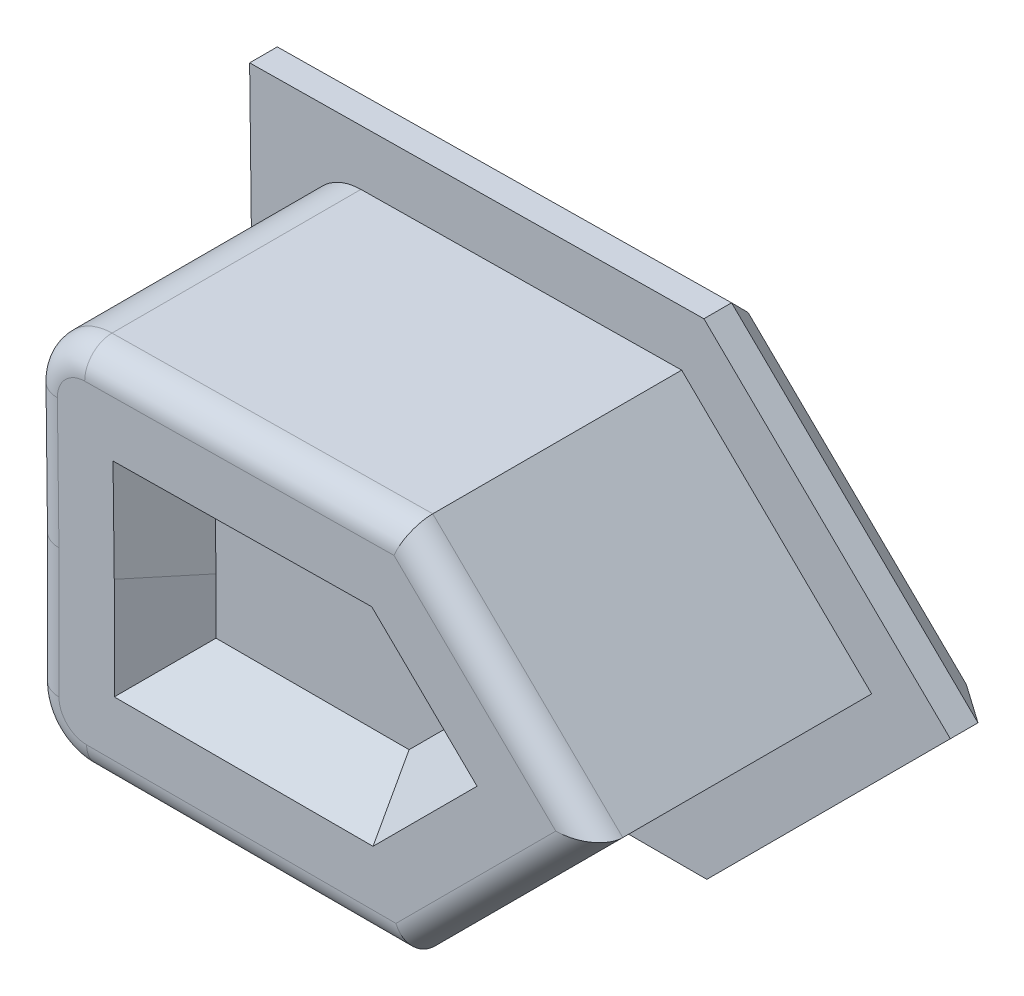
ISO-10303-21;
HEADER;
FILE_DESCRIPTION(('STEP AP214'),'2;1');
FILE_NAME('part.step','',(''),(''),'','','');
FILE_SCHEMA(('AUTOMOTIVE_DESIGN { 1 0 10303 214 1 1 1 1 }'));
ENDSEC;
DATA;
#1=APPLICATION_CONTEXT('core data for automotive mechanical design processes');
#2=APPLICATION_PROTOCOL_DEFINITION('international standard','automotive_design',2000,#1);
#3=PRODUCT_CONTEXT('',#1,'mechanical');
#4=PRODUCT('Part','Part','',(#3));
#5=PRODUCT_RELATED_PRODUCT_CATEGORY('part','',(#4));
#6=PRODUCT_DEFINITION_FORMATION('','',#4);
#7=PRODUCT_DEFINITION_CONTEXT('part definition',#1,'design');
#8=PRODUCT_DEFINITION('design','',#6,#7);
#9=PRODUCT_DEFINITION_SHAPE('','',#8);
#10=(LENGTH_UNIT() NAMED_UNIT(*) SI_UNIT(.MILLI.,.METRE.));
#11=(NAMED_UNIT(*) PLANE_ANGLE_UNIT() SI_UNIT($,.RADIAN.));
#12=(NAMED_UNIT(*) SI_UNIT($,.STERADIAN.) SOLID_ANGLE_UNIT());
#13=UNCERTAINTY_MEASURE_WITH_UNIT(LENGTH_MEASURE(1.E-05),#10,'distance_accuracy_value','');
#14=(GEOMETRIC_REPRESENTATION_CONTEXT(3) GLOBAL_UNCERTAINTY_ASSIGNED_CONTEXT((#13)) GLOBAL_UNIT_ASSIGNED_CONTEXT((#10,
#11,#12)) REPRESENTATION_CONTEXT('',''));
#15=CARTESIAN_POINT('',(0.,0.,0.));
#16=DIRECTION('',(0.,0.,1.));
#17=DIRECTION('',(1.,0.,0.));
#18=AXIS2_PLACEMENT_3D('',#15,#16,#17);
#19=CARTESIAN_POINT('',(-5.09705627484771,-3.36320898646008,5.));
#20=DIRECTION('',(1.,0.,0.));
#21=DIRECTION('',(0.,0.,-1.));
#22=AXIS2_PLACEMENT_3D('',#19,#20,#21);
#23=PLANE('',#22);
#24=DIRECTION('',(0.,0.,-1.));
#25=VECTOR('',#24,1.);
#26=CARTESIAN_POINT('',(-5.09705627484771,-2.36320898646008,5.));
#27=LINE('',#26,#25);
#28=CARTESIAN_POINT('',(-5.09705627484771,-2.36320898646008,0.));
#29=VERTEX_POINT('',#28);
#30=CARTESIAN_POINT('',(-5.09705627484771,-2.36320898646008,4.5));
#31=VERTEX_POINT('',#30);
#32=EDGE_CURVE('E378',#29,#31,#27,.F.);
#33=ORIENTED_EDGE('',*,*,#32,.T.);
#34=DIRECTION('',(0.,-1.,0.));
#35=VECTOR('',#34,1.);
#36=CARTESIAN_POINT('',(-5.09705627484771,-3.36320898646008,4.5));
#37=LINE('',#36,#35);
#38=CARTESIAN_POINT('',(-5.09705627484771,-0.0309035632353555,4.5));
#39=VERTEX_POINT('',#38);
#40=EDGE_CURVE('E417',#31,#39,#37,.F.);
#41=ORIENTED_EDGE('',*,*,#40,.T.);
#42=DIRECTION('',(0.,0.,-1.));
#43=VECTOR('',#42,1.);
#44=CARTESIAN_POINT('',(-5.09705627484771,-0.0309035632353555,5.));
#45=LINE('',#44,#43);
#46=CARTESIAN_POINT('',(-5.09705627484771,-0.0309035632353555,0.));
#47=VERTEX_POINT('',#46);
#48=EDGE_CURVE('E328',#39,#47,#45,.T.);
#49=ORIENTED_EDGE('',*,*,#48,.T.);
#50=DIRECTION('',(0.,-1.,0.));
#51=VECTOR('',#50,1.);
#52=CARTESIAN_POINT('',(-5.09705627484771,-3.36320898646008,0.));
#53=LINE('',#52,#51);
#54=EDGE_CURVE('E310',#47,#29,#53,.T.);
#55=ORIENTED_EDGE('',*,*,#54,.T.);
#56=EDGE_LOOP('',(#33,#41,#49,#55));
#57=FACE_BOUND('',#56,.T.);
#58=ADVANCED_FACE('F39',(#57),#23,.F.);
#59=CARTESIAN_POINT('',(-5.09705627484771,-3.36320898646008,5.));
#60=DIRECTION('',(0.,1.,0.));
#61=DIRECTION('',(0.,0.,1.));
#62=AXIS2_PLACEMENT_3D('',#59,#60,#61);
#63=PLANE('',#62);
#64=DIRECTION('',(0.,0.,-1.));
#65=VECTOR('',#64,1.);
#66=CARTESIAN_POINT('',(1.70294372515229,-3.36320898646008,5.));
#67=LINE('',#66,#65);
#68=CARTESIAN_POINT('',(1.70294372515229,-3.36320898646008,4.5));
#69=VERTEX_POINT('',#68);
#70=CARTESIAN_POINT('',(1.70294372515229,-3.36320898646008,0.));
#71=VERTEX_POINT('',#70);
#72=EDGE_CURVE('E334',#69,#71,#67,.T.);
#73=ORIENTED_EDGE('',*,*,#72,.F.);
#74=DIRECTION('',(1.,0.,0.));
#75=VECTOR('',#74,1.);
#76=CARTESIAN_POINT('',(-5.09705627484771,-3.36320898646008,4.5));
#77=LINE('',#76,#75);
#78=CARTESIAN_POINT('',(-4.09705627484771,-3.36320898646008,4.5));
#79=VERTEX_POINT('',#78);
#80=EDGE_CURVE('E11',#69,#79,#77,.F.);
#81=ORIENTED_EDGE('',*,*,#80,.T.);
#82=DIRECTION('',(0.,0.,-1.));
#83=VECTOR('',#82,1.);
#84=CARTESIAN_POINT('',(-4.09705627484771,-3.36320898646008,5.));
#85=LINE('',#84,#83);
#86=CARTESIAN_POINT('',(-4.09705627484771,-3.36320898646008,0.));
#87=VERTEX_POINT('',#86);
#88=EDGE_CURVE('E362',#79,#87,#85,.T.);
#89=ORIENTED_EDGE('',*,*,#88,.T.);
#90=DIRECTION('',(1.,0.,0.));
#91=VECTOR('',#90,1.);
#92=CARTESIAN_POINT('',(-5.09705627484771,-3.36320898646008,0.));
#93=LINE('',#92,#91);
#94=EDGE_CURVE('E313',#87,#71,#93,.T.);
#95=ORIENTED_EDGE('',*,*,#94,.T.);
#96=EDGE_LOOP('',(#73,#81,#89,#95));
#97=FACE_BOUND('',#96,.T.);
#98=ADVANCED_FACE('F474',(#97),#63,.F.);
#99=CARTESIAN_POINT('',(1.70294372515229,-3.36320898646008,5.));
#100=DIRECTION('',(-0.70710678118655,0.707106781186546,0.));
#101=DIRECTION('',(-0.707106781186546,-0.70710678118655,0.));
#102=AXIS2_PLACEMENT_3D('',#99,#100,#101);
#103=PLANE('',#102);
#104=DIRECTION('',(0.,0.,-1.));
#105=VECTOR('',#104,1.);
#106=CARTESIAN_POINT('',(5.09705627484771,0.0309035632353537,5.));
#107=LINE('',#106,#105);
#108=CARTESIAN_POINT('',(5.09705627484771,0.0309035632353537,4.5));
#109=VERTEX_POINT('',#108);
#110=CARTESIAN_POINT('',(5.09705627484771,0.0309035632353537,0.));
#111=VERTEX_POINT('',#110);
#112=EDGE_CURVE('E332',#109,#111,#107,.T.);
#113=ORIENTED_EDGE('',*,*,#112,.F.);
#114=DIRECTION('',(0.707106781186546,0.70710678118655,0.));
#115=VECTOR('',#114,1.);
#116=CARTESIAN_POINT('',(1.70294372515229,-3.36320898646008,4.5));
#117=LINE('',#116,#115);
#118=EDGE_CURVE('E406',#109,#69,#117,.F.);
#119=ORIENTED_EDGE('',*,*,#118,.T.);
#120=ORIENTED_EDGE('',*,*,#72,.T.);
#121=DIRECTION('',(0.707106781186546,0.70710678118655,0.));
#122=VECTOR('',#121,1.);
#123=CARTESIAN_POINT('',(1.70294372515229,-3.36320898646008,0.));
#124=LINE('',#123,#122);
#125=EDGE_CURVE('E316',#71,#111,#124,.T.);
#126=ORIENTED_EDGE('',*,*,#125,.T.);
#127=EDGE_LOOP('',(#113,#119,#120,#126));
#128=FACE_BOUND('',#127,.T.);
#129=ADVANCED_FACE('F481',(#128),#103,.F.);
#130=CARTESIAN_POINT('',(1.66203760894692,3.38361094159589,5.));
#131=DIRECTION('',(-0.698480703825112,-0.715628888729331,0.));
#132=DIRECTION('',(0.715628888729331,-0.698480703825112,0.));
#133=AXIS2_PLACEMENT_3D('',#130,#131,#132);
#134=PLANE('',#133);
#135=DIRECTION('',(0.,0.,-1.));
#136=VECTOR('',#135,1.);
#137=CARTESIAN_POINT('',(1.66203760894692,3.38361094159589,5.));
#138=LINE('',#137,#136);
#139=CARTESIAN_POINT('',(1.66203760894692,3.38361094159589,4.5));
#140=VERTEX_POINT('',#139);
#141=CARTESIAN_POINT('',(1.66203760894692,3.38361094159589,0.));
#142=VERTEX_POINT('',#141);
#143=EDGE_CURVE('E330',#140,#142,#138,.T.);
#144=ORIENTED_EDGE('',*,*,#143,.F.);
#145=DIRECTION('',(-0.715628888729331,0.698480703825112,0.));
#146=VECTOR('',#145,1.);
#147=CARTESIAN_POINT('',(1.66203760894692,3.38361094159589,4.5));
#148=LINE('',#147,#146);
#149=EDGE_CURVE('E409',#140,#109,#148,.F.);
#150=ORIENTED_EDGE('',*,*,#149,.T.);
#151=ORIENTED_EDGE('',*,*,#112,.T.);
#152=DIRECTION('',(-0.715628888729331,0.698480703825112,0.));
#153=VECTOR('',#152,1.);
#154=CARTESIAN_POINT('',(1.66203760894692,3.38361094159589,0.));
#155=LINE('',#154,#153);
#156=EDGE_CURVE('E319',#111,#142,#155,.T.);
#157=ORIENTED_EDGE('',*,*,#156,.T.);
#158=EDGE_LOOP('',(#144,#150,#151,#157));
#159=FACE_BOUND('',#158,.T.);
#160=ADVANCED_FACE('F580',(#159),#134,.F.);
#161=CARTESIAN_POINT('',(-5.13746247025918,3.30115687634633,5.));
#162=DIRECTION('',(0.0121255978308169,-0.999926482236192,0.));
#163=DIRECTION('',(0.999926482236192,0.0121255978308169,0.));
#164=AXIS2_PLACEMENT_3D('',#161,#162,#163);
#165=PLANE('',#164);
#166=DIRECTION('',(0.,0.,-1.));
#167=VECTOR('',#166,1.);
#168=CARTESIAN_POINT('',(-4.13753598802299,3.31328247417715,5.));
#169=LINE('',#168,#167);
#170=CARTESIAN_POINT('',(-4.13753598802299,3.31328247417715,0.));
#171=VERTEX_POINT('',#170);
#172=CARTESIAN_POINT('',(-4.13753598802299,3.31328247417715,4.5));
#173=VERTEX_POINT('',#172);
#174=EDGE_CURVE('E382',#171,#173,#169,.F.);
#175=ORIENTED_EDGE('',*,*,#174,.T.);
#176=DIRECTION('',(-0.999926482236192,-0.0121255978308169,0.));
#177=VECTOR('',#176,1.);
#178=CARTESIAN_POINT('',(-5.13746247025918,3.30115687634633,4.5));
#179=LINE('',#178,#177);
#180=EDGE_CURVE('E411',#173,#140,#179,.F.);
#181=ORIENTED_EDGE('',*,*,#180,.T.);
#182=ORIENTED_EDGE('',*,*,#143,.T.);
#183=DIRECTION('',(-0.999926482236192,-0.0121255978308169,0.));
#184=VECTOR('',#183,1.);
#185=CARTESIAN_POINT('',(-5.13746247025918,3.30115687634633,0.));
#186=LINE('',#185,#184);
#187=EDGE_CURVE('E322',#142,#171,#186,.T.);
#188=ORIENTED_EDGE('',*,*,#187,.T.);
#189=EDGE_LOOP('',(#175,#181,#182,#188));
#190=FACE_BOUND('',#189,.T.);
#191=ADVANCED_FACE('F570',(#190),#165,.F.);
#192=CARTESIAN_POINT('',(-5.13746247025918,3.30115687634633,5.));
#193=DIRECTION('',(0.999926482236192,0.0121255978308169,0.));
#194=DIRECTION('',(-0.0121255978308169,0.999926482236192,0.));
#195=AXIS2_PLACEMENT_3D('',#192,#193,#194);
#196=PLANE('',#195);
#197=ORIENTED_EDGE('',*,*,#48,.F.);
#198=DIRECTION('',(0.0121255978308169,-0.999926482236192,0.));
#199=VECTOR('',#198,1.);
#200=CARTESIAN_POINT('',(-5.13746247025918,3.30115687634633,4.5));
#201=LINE('',#200,#199);
#202=CARTESIAN_POINT('',(-5.12533687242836,2.30123039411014,4.5));
#203=VERTEX_POINT('',#202);
#204=EDGE_CURVE('E415',#39,#203,#201,.F.);
#205=ORIENTED_EDGE('',*,*,#204,.T.);
#206=DIRECTION('',(0.,0.,-1.));
#207=VECTOR('',#206,1.);
#208=CARTESIAN_POINT('',(-5.12533687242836,2.30123039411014,5.));
#209=LINE('',#208,#207);
#210=CARTESIAN_POINT('',(-5.12533687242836,2.30123039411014,0.));
#211=VERTEX_POINT('',#210);
#212=EDGE_CURVE('E380',#203,#211,#209,.T.);
#213=ORIENTED_EDGE('',*,*,#212,.T.);
#214=DIRECTION('',(0.0121255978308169,-0.999926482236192,0.));
#215=VECTOR('',#214,1.);
#216=CARTESIAN_POINT('',(-5.13746247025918,3.30115687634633,0.));
#217=LINE('',#216,#215);
#218=EDGE_CURVE('E325',#211,#47,#217,.T.);
#219=ORIENTED_EDGE('',*,*,#218,.T.);
#220=EDGE_LOOP('',(#197,#205,#213,#219));
#221=FACE_BOUND('',#220,.T.);
#222=ADVANCED_FACE('F598',(#221),#196,.F.);
#223=CARTESIAN_POINT('',(0.,0.,5.));
#224=DIRECTION('',(0.,0.,-1.));
#225=DIRECTION('',(-1.,0.,0.));
#226=AXIS2_PLACEMENT_3D('',#223,#224,#225);
#227=PLANE('',#226);
#228=DIRECTION('',(1.,0.,0.));
#229=VECTOR('',#228,1.);
#230=CARTESIAN_POINT('',(0.,-2.86320898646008,5.));
#231=LINE('',#230,#229);
#232=CARTESIAN_POINT('',(-4.09705627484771,-2.86320898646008,5.));
#233=VERTEX_POINT('',#232);
#234=CARTESIAN_POINT('',(1.49583694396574,-2.86320898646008,5.));
#235=VERTEX_POINT('',#234);
#236=EDGE_CURVE('E389',#233,#235,#231,.T.);
#237=ORIENTED_EDGE('',*,*,#236,.T.);
#238=DIRECTION('',(0.707106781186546,0.70710678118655,0.));
#239=VECTOR('',#238,1.);
#240=CARTESIAN_POINT('',(2.17952296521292,-2.17952296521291,5.));
#241=LINE('',#240,#239);
#242=CARTESIAN_POINT('',(4.38563613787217,0.0265902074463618,5.));
#243=VERTEX_POINT('',#242);
#244=EDGE_CURVE('E403',#235,#243,#241,.T.);
#245=ORIENTED_EDGE('',*,*,#244,.T.);
#246=DIRECTION('',(-0.715628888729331,0.698480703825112,0.));
#247=VECTOR('',#246,1.);
#248=CARTESIAN_POINT('',(2.15293471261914,2.20579075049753,5.));
#249=LINE('',#248,#247);
#250=CARTESIAN_POINT('',(1.4610088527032,2.88113640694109,5.));
#251=VERTEX_POINT('',#250);
#252=EDGE_CURVE('E401',#243,#251,#249,.T.);
#253=ORIENTED_EDGE('',*,*,#252,.T.);
#254=DIRECTION('',(-0.999926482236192,-0.0121255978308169,0.));
#255=VECTOR('',#254,1.);
#256=CARTESIAN_POINT('',(-0.0347181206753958,2.86299848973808,5.));
#257=LINE('',#256,#255);
#258=CARTESIAN_POINT('',(-4.13147318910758,2.81331923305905,5.));
#259=VERTEX_POINT('',#258);
#260=EDGE_CURVE('E399',#251,#259,#257,.T.);
#261=ORIENTED_EDGE('',*,*,#260,.T.);
#262=CARTESIAN_POINT('',(-4.12541039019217,2.31335599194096,5.));
#263=DIRECTION('',(0.,0.,-1.));
#264=DIRECTION('',(-1.,0.,0.));
#265=AXIS2_PLACEMENT_3D('',#262,#263,#264);
#266=CIRCLE('',#265,0.5);
#267=CARTESIAN_POINT('',(-4.62537363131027,2.30729319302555,5.));
#268=VERTEX_POINT('',#267);
#269=EDGE_CURVE('E397',#259,#268,#266,.F.);
#270=ORIENTED_EDGE('',*,*,#269,.T.);
#271=DIRECTION('',(0.0121255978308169,-0.999926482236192,0.));
#272=VECTOR('',#271,1.);
#273=CARTESIAN_POINT('',(-4.59671830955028,-0.0557420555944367,5.));
#274=LINE('',#273,#272);
#275=CARTESIAN_POINT('',(-4.59705627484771,-0.0278720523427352,5.));
#276=VERTEX_POINT('',#275);
#277=EDGE_CURVE('E395',#268,#276,#274,.T.);
#278=ORIENTED_EDGE('',*,*,#277,.T.);
#279=DIRECTION('',(0.,-1.,0.));
#280=VECTOR('',#279,1.);
#281=CARTESIAN_POINT('',(-4.59705627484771,0.,5.));
#282=LINE('',#281,#280);
#283=CARTESIAN_POINT('',(-4.59705627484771,-2.36320898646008,5.));
#284=VERTEX_POINT('',#283);
#285=EDGE_CURVE('E393',#276,#284,#282,.T.);
#286=ORIENTED_EDGE('',*,*,#285,.T.);
#287=CARTESIAN_POINT('',(-4.09705627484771,-2.36320898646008,5.));
#288=DIRECTION('',(0.,0.,-1.));
#289=DIRECTION('',(-1.,0.,0.));
#290=AXIS2_PLACEMENT_3D('',#287,#288,#289);
#291=CIRCLE('',#290,0.5);
#292=EDGE_CURVE('E391',#284,#233,#291,.F.);
#293=ORIENTED_EDGE('',*,*,#292,.T.);
#294=EDGE_LOOP('',(#237,#245,#253,#261,#270,#278,#286,#293));
#295=FACE_BOUND('',#294,.T.);
#296=DIRECTION('',(0.,-1.,0.));
#297=VECTOR('',#296,1.);
#298=CARTESIAN_POINT('',(-3.59705627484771,-0.0218090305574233,5.));
#299=LINE('',#298,#297);
#300=CARTESIAN_POINT('',(-3.59705627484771,-0.0218090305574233,5.));
#301=VERTEX_POINT('',#300);
#302=CARTESIAN_POINT('',(-3.59705627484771,-1.86320898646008,5.));
#303=VERTEX_POINT('',#302);
#304=EDGE_CURVE('E235',#301,#303,#299,.T.);
#305=ORIENTED_EDGE('',*,*,#304,.F.);
#306=DIRECTION('',(0.0121255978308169,-0.999926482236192,0.));
#307=VECTOR('',#306,1.);
#308=CARTESIAN_POINT('',(-3.61938435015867,1.81945554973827,5.));
#309=LINE('',#308,#307);
#310=CARTESIAN_POINT('',(-3.61938435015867,1.81945554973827,5.));
#311=VERTEX_POINT('',#310);
#312=EDGE_CURVE('E239',#311,#301,#309,.T.);
#313=ORIENTED_EDGE('',*,*,#312,.F.);
#314=DIRECTION('',(-0.999926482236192,-0.0121255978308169,0.));
#315=VECTOR('',#314,1.);
#316=CARTESIAN_POINT('',(1.05895134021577,1.87618733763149,5.));
#317=LINE('',#316,#315);
#318=CARTESIAN_POINT('',(1.05895134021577,1.87618733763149,5.));
#319=VERTEX_POINT('',#318);
#320=EDGE_CURVE('E252',#319,#311,#317,.T.);
#321=ORIENTED_EDGE('',*,*,#320,.F.);
#322=DIRECTION('',(-0.715628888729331,0.698480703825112,0.));
#323=VECTOR('',#322,1.);
#324=CARTESIAN_POINT('',(2.9627958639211,0.0179634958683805,5.));
#325=LINE('',#324,#323);
#326=CARTESIAN_POINT('',(2.9627958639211,0.0179634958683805,5.));
#327=VERTEX_POINT('',#326);
#328=EDGE_CURVE('E246',#327,#319,#325,.T.);
#329=ORIENTED_EDGE('',*,*,#328,.F.);
#330=DIRECTION('',(0.707106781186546,0.707106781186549,0.));
#331=VECTOR('',#330,1.);
#332=CARTESIAN_POINT('',(1.08162338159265,-1.86320898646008,5.));
#333=LINE('',#332,#331);
#334=CARTESIAN_POINT('',(1.08162338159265,-1.86320898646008,5.));
#335=VERTEX_POINT('',#334);
#336=EDGE_CURVE('E244',#335,#327,#333,.T.);
#337=ORIENTED_EDGE('',*,*,#336,.F.);
#338=DIRECTION('',(1.,0.,0.));
#339=VECTOR('',#338,1.);
#340=CARTESIAN_POINT('',(-3.59705627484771,-1.86320898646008,5.));
#341=LINE('',#340,#339);
#342=EDGE_CURVE('E223',#303,#335,#341,.T.);
#343=ORIENTED_EDGE('',*,*,#342,.F.);
#344=EDGE_LOOP('',(#305,#313,#321,#329,#337,#343));
#345=FACE_BOUND('',#344,.T.);
#346=ADVANCED_FACE('F241',(#295,#345),#227,.F.);
#347=CARTESIAN_POINT('',(3.24018313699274,-3.24018313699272,-1.));
#348=DIRECTION('',(-0.70710678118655,0.707106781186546,0.));
#349=DIRECTION('',(-0.707106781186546,-0.70710678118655,0.));
#350=AXIS2_PLACEMENT_3D('',#347,#348,#349);
#351=PLANE('',#350);
#352=DIRECTION('',(0.,0.,1.));
#353=VECTOR('',#352,1.);
#354=CARTESIAN_POINT('',(2.11715728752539,-4.36320898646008,-1.));
#355=LINE('',#354,#353);
#356=CARTESIAN_POINT('',(2.11715728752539,-4.36320898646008,-0.500000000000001));
#357=VERTEX_POINT('',#356);
#358=CARTESIAN_POINT('',(2.11715728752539,-4.36320898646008,0.));
#359=VERTEX_POINT('',#358);
#360=EDGE_CURVE('E308',#357,#359,#355,.T.);
#361=ORIENTED_EDGE('',*,*,#360,.F.);
#362=DIRECTION('',(0.707106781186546,0.70710678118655,0.));
#363=VECTOR('',#362,1.);
#364=CARTESIAN_POINT('',(6.51989654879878,0.0395302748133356,-0.500000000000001));
#365=LINE('',#364,#363);
#366=CARTESIAN_POINT('',(6.51989654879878,0.039530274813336,-0.500000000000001));
#367=VERTEX_POINT('',#366);
#368=EDGE_CURVE('E360',#357,#367,#365,.T.);
#369=ORIENTED_EDGE('',*,*,#368,.T.);
#370=DIRECTION('',(0.,0.,1.));
#371=VECTOR('',#370,1.);
#372=CARTESIAN_POINT('',(6.51989654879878,0.039530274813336,-1.));
#373=LINE('',#372,#371);
#374=CARTESIAN_POINT('',(6.51989654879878,0.039530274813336,0.));
#375=VERTEX_POINT('',#374);
#376=EDGE_CURVE('E298',#367,#375,#373,.T.);
#377=ORIENTED_EDGE('',*,*,#376,.T.);
#378=DIRECTION('',(-0.707106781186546,-0.70710678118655,0.));
#379=VECTOR('',#378,1.);
#380=CARTESIAN_POINT('',(3.24018313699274,-3.24018313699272,0.));
#381=LINE('',#380,#379);
#382=EDGE_CURVE('E279',#375,#359,#381,.T.);
#383=ORIENTED_EDGE('',*,*,#382,.T.);
#384=EDGE_LOOP('',(#361,#369,#377,#383));
#385=FACE_BOUND('',#384,.T.);
#386=ADVANCED_FACE('F607',(#385),#351,.F.);
#387=CARTESIAN_POINT('',(0.,-4.36320898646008,-1.));
#388=DIRECTION('',(0.,1.,0.));
#389=DIRECTION('',(0.,0.,1.));
#390=AXIS2_PLACEMENT_3D('',#387,#388,#389);
#391=PLANE('',#390);
#392=DIRECTION('',(0.,0.,1.));
#393=VECTOR('',#392,1.);
#394=CARTESIAN_POINT('',(-6.09705627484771,-4.36320898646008,-1.));
#395=LINE('',#394,#393);
#396=CARTESIAN_POINT('',(-6.09705627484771,-4.36320898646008,-0.500000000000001));
#397=VERTEX_POINT('',#396);
#398=CARTESIAN_POINT('',(-6.09705627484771,-4.36320898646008,0.));
#399=VERTEX_POINT('',#398);
#400=EDGE_CURVE('E306',#397,#399,#395,.T.);
#401=ORIENTED_EDGE('',*,*,#400,.F.);
#402=DIRECTION('',(1.,0.,0.));
#403=VECTOR('',#402,1.);
#404=CARTESIAN_POINT('',(2.11715728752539,-4.36320898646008,-0.500000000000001));
#405=LINE('',#404,#403);
#406=EDGE_CURVE('E358',#397,#357,#405,.T.);
#407=ORIENTED_EDGE('',*,*,#406,.T.);
#408=ORIENTED_EDGE('',*,*,#360,.T.);
#409=DIRECTION('',(-1.,0.,0.));
#410=VECTOR('',#409,1.);
#411=CARTESIAN_POINT('',(0.,-4.36320898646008,0.));
#412=LINE('',#411,#410);
#413=EDGE_CURVE('E282',#359,#399,#412,.T.);
#414=ORIENTED_EDGE('',*,*,#413,.T.);
#415=EDGE_LOOP('',(#401,#407,#408,#414));
#416=FACE_BOUND('',#415,.T.);
#417=ADVANCED_FACE('F645',(#416),#391,.F.);
#418=CARTESIAN_POINT('',(-6.09705627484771,0.,-1.));
#419=DIRECTION('',(1.,0.,0.));
#420=DIRECTION('',(0.,0.,-1.));
#421=AXIS2_PLACEMENT_3D('',#418,#419,#420);
#422=PLANE('',#421);
#423=DIRECTION('',(0.,0.,1.));
#424=VECTOR('',#423,1.);
#425=CARTESIAN_POINT('',(-6.09705627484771,-0.0369665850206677,-1.));
#426=LINE('',#425,#424);
#427=CARTESIAN_POINT('',(-6.09705627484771,-0.0369665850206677,-0.500000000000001));
#428=VERTEX_POINT('',#427);
#429=CARTESIAN_POINT('',(-6.09705627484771,-0.0369665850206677,0.));
#430=VERTEX_POINT('',#429);
#431=EDGE_CURVE('E304',#428,#430,#426,.T.);
#432=ORIENTED_EDGE('',*,*,#431,.F.);
#433=DIRECTION('',(0.,-1.,0.));
#434=VECTOR('',#433,1.);
#435=CARTESIAN_POINT('',(-6.09705627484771,-4.36320898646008,-0.500000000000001));
#436=LINE('',#435,#434);
#437=EDGE_CURVE('E356',#428,#397,#436,.T.);
#438=ORIENTED_EDGE('',*,*,#437,.T.);
#439=ORIENTED_EDGE('',*,*,#400,.T.);
#440=DIRECTION('',(0.,1.,0.));
#441=VECTOR('',#440,1.);
#442=CARTESIAN_POINT('',(-6.09705627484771,0.,0.));
#443=LINE('',#442,#441);
#444=EDGE_CURVE('E286',#399,#430,#443,.T.);
#445=ORIENTED_EDGE('',*,*,#444,.T.);
#446=EDGE_LOOP('',(#432,#438,#439,#445));
#447=FACE_BOUND('',#446,.T.);
#448=ADVANCED_FACE('F651',(#447),#422,.F.);
#449=CARTESIAN_POINT('',(-6.09660803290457,-0.0739304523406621,-1.));
#450=DIRECTION('',(0.999926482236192,0.0121255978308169,0.));
#451=DIRECTION('',(-0.0121255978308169,0.999926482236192,0.));
#452=AXIS2_PLACEMENT_3D('',#449,#450,#451);
#453=PLANE('',#452);
#454=DIRECTION('',(0.,0.,1.));
#455=VECTOR('',#454,1.);
#456=CARTESIAN_POINT('',(-6.14951455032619,4.28895776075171,-1.));
#457=LINE('',#456,#455);
#458=CARTESIAN_POINT('',(-6.14951455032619,4.28895776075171,-0.500000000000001));
#459=VERTEX_POINT('',#458);
#460=CARTESIAN_POINT('',(-6.14951455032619,4.28895776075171,0.));
#461=VERTEX_POINT('',#460);
#462=EDGE_CURVE('E302',#459,#461,#457,.T.);
#463=ORIENTED_EDGE('',*,*,#462,.F.);
#464=DIRECTION('',(0.0121255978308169,-0.999926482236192,0.));
#465=VECTOR('',#464,1.);
#466=CARTESIAN_POINT('',(-6.09705627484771,-0.0369665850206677,-0.500000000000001));
#467=LINE('',#466,#465);
#468=EDGE_CURVE('E354',#459,#428,#467,.T.);
#469=ORIENTED_EDGE('',*,*,#468,.T.);
#470=ORIENTED_EDGE('',*,*,#431,.T.);
#471=DIRECTION('',(-0.0121255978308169,0.999926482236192,0.));
#472=VECTOR('',#471,1.);
#473=CARTESIAN_POINT('',(-6.09660803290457,-0.0739304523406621,0.));
#474=LINE('',#473,#472);
#475=EDGE_CURVE('E289',#430,#461,#474,.T.);
#476=ORIENTED_EDGE('',*,*,#475,.T.);
#477=EDGE_LOOP('',(#463,#469,#470,#476));
#478=FACE_BOUND('',#477,.T.);
#479=ADVANCED_FACE('F659',(#478),#453,.F.);
#480=CARTESIAN_POINT('',(-0.0529065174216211,4.36288821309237,-1.));
#481=DIRECTION('',(0.0121255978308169,-0.999926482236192,0.));
#482=DIRECTION('',(0.999926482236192,0.0121255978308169,0.));
#483=AXIS2_PLACEMENT_3D('',#480,#481,#482);
#484=PLANE('',#483);
#485=DIRECTION('',(0.,0.,1.));
#486=VECTOR('',#485,1.);
#487=CARTESIAN_POINT('',(2.06409512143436,4.38856001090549,-1.));
#488=LINE('',#487,#486);
#489=CARTESIAN_POINT('',(2.06409512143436,4.38856001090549,-0.500000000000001));
#490=VERTEX_POINT('',#489);
#491=CARTESIAN_POINT('',(2.06409512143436,4.38856001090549,0.));
#492=VERTEX_POINT('',#491);
#493=EDGE_CURVE('E300',#490,#492,#488,.T.);
#494=ORIENTED_EDGE('',*,*,#493,.F.);
#495=DIRECTION('',(-0.999926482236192,-0.0121255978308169,0.));
#496=VECTOR('',#495,1.);
#497=CARTESIAN_POINT('',(-6.14951455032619,4.28895776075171,-0.500000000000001));
#498=LINE('',#497,#496);
#499=EDGE_CURVE('E352',#490,#459,#498,.T.);
#500=ORIENTED_EDGE('',*,*,#499,.T.);
#501=ORIENTED_EDGE('',*,*,#462,.T.);
#502=DIRECTION('',(0.999926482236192,0.0121255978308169,0.));
#503=VECTOR('',#502,1.);
#504=CARTESIAN_POINT('',(-0.0529065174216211,4.36288821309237,0.));
#505=LINE('',#504,#503);
#506=EDGE_CURVE('E292',#461,#492,#505,.T.);
#507=ORIENTED_EDGE('',*,*,#506,.T.);
#508=EDGE_LOOP('',(#494,#500,#501,#507));
#509=FACE_BOUND('',#508,.T.);
#510=ADVANCED_FACE('F667',(#509),#484,.F.);
#511=CARTESIAN_POINT('',(3.20065576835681,3.27923408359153,-1.));
#512=DIRECTION('',(-0.698480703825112,-0.715628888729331,0.));
#513=DIRECTION('',(0.715628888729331,-0.698480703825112,0.));
#514=AXIS2_PLACEMENT_3D('',#511,#512,#513);
#515=PLANE('',#514);
#516=ORIENTED_EDGE('',*,*,#376,.F.);
#517=DIRECTION('',(-0.715628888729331,0.698480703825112,0.));
#518=VECTOR('',#517,1.);
#519=CARTESIAN_POINT('',(2.06409512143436,4.38856001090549,-0.500000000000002));
#520=LINE('',#519,#518);
#521=EDGE_CURVE('E349',#367,#490,#520,.T.);
#522=ORIENTED_EDGE('',*,*,#521,.T.);
#523=ORIENTED_EDGE('',*,*,#493,.T.);
#524=DIRECTION('',(0.715628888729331,-0.698480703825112,0.));
#525=VECTOR('',#524,1.);
#526=CARTESIAN_POINT('',(3.20065576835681,3.27923408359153,0.));
#527=LINE('',#526,#525);
#528=EDGE_CURVE('E295',#492,#375,#527,.T.);
#529=ORIENTED_EDGE('',*,*,#528,.T.);
#530=EDGE_LOOP('',(#516,#522,#523,#529));
#531=FACE_BOUND('',#530,.T.);
#532=ADVANCED_FACE('F675',(#531),#515,.F.);
#533=CARTESIAN_POINT('',(0.,0.,-1.));
#534=DIRECTION('',(0.,0.,-1.));
#535=DIRECTION('',(-1.,0.,0.));
#536=AXIS2_PLACEMENT_3D('',#533,#534,#535);
#537=PLANE('',#536);
#538=DIRECTION('',(0.999926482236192,0.0121255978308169,0.));
#539=VECTOR('',#538,1.);
#540=CARTESIAN_POINT('',(2.07015792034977,3.88859676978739,-1.));
#541=LINE('',#540,#539);
#542=CARTESIAN_POINT('',(-5.64348851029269,3.79505731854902,-1.));
#543=VERTEX_POINT('',#542);
#544=CARTESIAN_POINT('',(1.86306636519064,3.88608547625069,-1.));
#545=VERTEX_POINT('',#544);
#546=EDGE_CURVE('E344',#543,#545,#541,.T.);
#547=ORIENTED_EDGE('',*,*,#546,.T.);
#548=DIRECTION('',(0.715628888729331,-0.698480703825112,0.));
#549=VECTOR('',#548,1.);
#550=CARTESIAN_POINT('',(6.17065619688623,-0.318284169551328,-1.));
#551=LINE('',#550,#549);
#552=CARTESIAN_POINT('',(5.80847641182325,0.0352169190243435,-1.));
#553=VERTEX_POINT('',#552);
#554=EDGE_CURVE('E346',#545,#553,#551,.T.);
#555=ORIENTED_EDGE('',*,*,#554,.T.);
#556=DIRECTION('',(-0.707106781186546,-0.707106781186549,0.));
#557=VECTOR('',#556,1.);
#558=CARTESIAN_POINT('',(1.76360389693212,-4.00965559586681,-1.));
#559=LINE('',#558,#557);
#560=CARTESIAN_POINT('',(1.91005050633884,-3.86320898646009,-1.));
#561=VERTEX_POINT('',#560);
#562=EDGE_CURVE('E336',#553,#561,#559,.T.);
#563=ORIENTED_EDGE('',*,*,#562,.T.);
#564=DIRECTION('',(-1.,0.,0.));
#565=VECTOR('',#564,1.);
#566=CARTESIAN_POINT('',(-6.09705627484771,-3.86320898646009,-1.));
#567=LINE('',#566,#565);
#568=CARTESIAN_POINT('',(-5.59705627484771,-3.86320898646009,-1.));
#569=VERTEX_POINT('',#568);
#570=EDGE_CURVE('E338',#561,#569,#567,.T.);
#571=ORIENTED_EDGE('',*,*,#570,.T.);
#572=DIRECTION('',(0.,1.,0.));
#573=VECTOR('',#572,1.);
#574=CARTESIAN_POINT('',(-5.59705627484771,-0.0369665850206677,-1.));
#575=LINE('',#574,#573);
#576=CARTESIAN_POINT('',(-5.59705627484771,-0.0339350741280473,-1.));
#577=VERTEX_POINT('',#576);
#578=EDGE_CURVE('E340',#569,#577,#575,.T.);
#579=ORIENTED_EDGE('',*,*,#578,.T.);
#580=DIRECTION('',(-0.0121255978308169,0.999926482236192,0.));
#581=VECTOR('',#580,1.);
#582=CARTESIAN_POINT('',(-5.6495513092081,4.29502055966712,-1.));
#583=LINE('',#582,#581);
#584=EDGE_CURVE('E342',#577,#543,#583,.T.);
#585=ORIENTED_EDGE('',*,*,#584,.T.);
#586=EDGE_LOOP('',(#547,#555,#563,#571,#579,#585));
#587=FACE_BOUND('',#586,.T.);
#588=ADVANCED_FACE('F683',(#587),#537,.T.);
#589=CARTESIAN_POINT('',(0.,0.,0.));
#590=DIRECTION('',(0.,0.,-1.));
#591=DIRECTION('',(-1.,0.,0.));
#592=AXIS2_PLACEMENT_3D('',#589,#590,#591);
#593=PLANE('',#592);
#594=ORIENTED_EDGE('',*,*,#54,.F.);
#595=ORIENTED_EDGE('',*,*,#218,.F.);
#596=CARTESIAN_POINT('',(-4.12541039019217,2.31335599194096,0.));
#597=DIRECTION('',(0.,0.,-1.));
#598=DIRECTION('',(-1.,0.,0.));
#599=AXIS2_PLACEMENT_3D('',#596,#597,#598);
#600=CIRCLE('',#599,1.);
#601=EDGE_CURVE('E387',#211,#171,#600,.T.);
#602=ORIENTED_EDGE('',*,*,#601,.T.);
#603=ORIENTED_EDGE('',*,*,#187,.F.);
#604=ORIENTED_EDGE('',*,*,#156,.F.);
#605=ORIENTED_EDGE('',*,*,#125,.F.);
#606=ORIENTED_EDGE('',*,*,#94,.F.);
#607=CARTESIAN_POINT('',(-4.09705627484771,-2.36320898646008,0.));
#608=DIRECTION('',(0.,0.,-1.));
#609=DIRECTION('',(-1.,0.,0.));
#610=AXIS2_PLACEMENT_3D('',#607,#608,#609);
#611=CIRCLE('',#610,1.);
#612=EDGE_CURVE('E385',#87,#29,#611,.T.);
#613=ORIENTED_EDGE('',*,*,#612,.T.);
#614=EDGE_LOOP('',(#594,#595,#602,#603,#604,#605,#606,#613));
#615=FACE_BOUND('',#614,.T.);
#616=ORIENTED_EDGE('',*,*,#382,.F.);
#617=ORIENTED_EDGE('',*,*,#528,.F.);
#618=ORIENTED_EDGE('',*,*,#506,.F.);
#619=ORIENTED_EDGE('',*,*,#475,.F.);
#620=ORIENTED_EDGE('',*,*,#444,.F.);
#621=ORIENTED_EDGE('',*,*,#413,.F.);
#622=EDGE_LOOP('',(#616,#617,#618,#619,#620,#621));
#623=FACE_BOUND('',#622,.T.);
#624=ADVANCED_FACE('F525',(#615,#623),#593,.F.);
#625=CARTESIAN_POINT('',(-5.59705627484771,0.,-1.));
#626=DIRECTION('',(-0.707106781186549,0.,-0.707106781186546));
#627=DIRECTION('',(0.,-1.,0.));
#628=AXIS2_PLACEMENT_3D('',#625,#626,#627);
#629=PLANE('',#628);
#630=DIRECTION('',(0.577350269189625,0.577350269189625,-0.577350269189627));
#631=VECTOR('',#630,1.);
#632=CARTESIAN_POINT('',(-3.73137084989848,-1.99752356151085,-2.86568542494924));
#633=LINE('',#632,#631);
#634=EDGE_CURVE('E372',#397,#569,#633,.T.);
#635=ORIENTED_EDGE('',*,*,#634,.F.);
#636=ORIENTED_EDGE('',*,*,#437,.F.);
#637=DIRECTION('',(0.707100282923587,0.00428716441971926,-0.70710028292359));
#638=VECTOR('',#637,1.);
#639=CARTESIAN_POINT('',(-5.59695340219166,-0.0339344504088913,-1.00010287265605));
#640=LINE('',#639,#638);
#641=EDGE_CURVE('E283',#577,#428,#640,.F.);
#642=ORIENTED_EDGE('',*,*,#641,.F.);
#643=ORIENTED_EDGE('',*,*,#578,.F.);
#644=EDGE_LOOP('',(#635,#636,#642,#643));
#645=FACE_BOUND('',#644,.T.);
#646=ADVANCED_FACE('F520',(#645),#629,.T.);
#647=CARTESIAN_POINT('',(-5.59664479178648,-0.0678676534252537,-1.));
#648=DIRECTION('',(-0.707054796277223,-0.00857409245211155,-0.707106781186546));
#649=DIRECTION('',(0.0121255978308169,-0.999926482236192,0.));
#650=AXIS2_PLACEMENT_3D('',#647,#648,#649);
#651=PLANE('',#650);
#652=ORIENTED_EDGE('',*,*,#641,.T.);
#653=ORIENTED_EDGE('',*,*,#468,.F.);
#654=DIRECTION('',(0.584308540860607,-0.570307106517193,-0.577350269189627));
#655=VECTOR('',#654,1.);
#656=CARTESIAN_POINT('',(-4.34023228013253,2.52303023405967,-2.28773632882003));
#657=LINE('',#656,#655);
#658=EDGE_CURVE('E369',#543,#459,#657,.F.);
#659=ORIENTED_EDGE('',*,*,#658,.F.);
#660=ORIENTED_EDGE('',*,*,#584,.F.);
#661=EDGE_LOOP('',(#652,#653,#659,#660));
#662=FACE_BOUND('',#661,.T.);
#663=ADVANCED_FACE('F513',(#662),#651,.T.);
#664=CARTESIAN_POINT('',(0.,-3.86320898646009,-1.));
#665=DIRECTION('',(0.,-0.707106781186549,-0.707106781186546));
#666=DIRECTION('',(1.,0.,0.));
#667=AXIS2_PLACEMENT_3D('',#664,#665,#666);
#668=PLANE('',#667);
#669=ORIENTED_EDGE('',*,*,#634,.T.);
#670=ORIENTED_EDGE('',*,*,#570,.F.);
#671=DIRECTION('',(-0.281084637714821,0.678598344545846,-0.678598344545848));
#672=VECTOR('',#671,1.);
#673=CARTESIAN_POINT('',(1.80093242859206,-3.59977464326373,-1.26343434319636));
#674=LINE('',#673,#672);
#675=EDGE_CURVE('E366',#357,#561,#674,.T.);
#676=ORIENTED_EDGE('',*,*,#675,.F.);
#677=ORIENTED_EDGE('',*,*,#406,.F.);
#678=EDGE_LOOP('',(#669,#670,#676,#677));
#679=FACE_BOUND('',#678,.T.);
#680=ADVANCED_FACE('F506',(#679),#668,.T.);
#681=CARTESIAN_POINT('',(-0.0468437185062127,3.86292497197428,-1.));
#682=DIRECTION('',(-0.00857409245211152,0.707054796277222,-0.707106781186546));
#683=DIRECTION('',(-0.999926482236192,-0.0121255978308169,0.));
#684=AXIS2_PLACEMENT_3D('',#681,#682,#683);
#685=PLANE('',#684);
#686=ORIENTED_EDGE('',*,*,#658,.T.);
#687=ORIENTED_EDGE('',*,*,#499,.F.);
#688=DIRECTION('',(-0.272835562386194,-0.681956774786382,-0.678598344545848));
#689=VECTOR('',#688,1.);
#690=CARTESIAN_POINT('',(1.71658481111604,3.5199525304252,-1.36432985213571));
#691=LINE('',#690,#689);
#692=EDGE_CURVE('E364',#545,#490,#691,.F.);
#693=ORIENTED_EDGE('',*,*,#692,.F.);
#694=ORIENTED_EDGE('',*,*,#546,.F.);
#695=EDGE_LOOP('',(#686,#687,#693,#694));
#696=FACE_BOUND('',#695,.T.);
#697=ADVANCED_FACE('F499',(#696),#685,.T.);
#698=CARTESIAN_POINT('',(2.88662974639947,-2.88662974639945,-1.));
#699=DIRECTION('',(0.500000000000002,-0.5,-0.707106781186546));
#700=DIRECTION('',(0.707106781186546,0.70710678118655,0.));
#701=AXIS2_PLACEMENT_3D('',#698,#699,#700);
#702=PLANE('',#701);
#703=ORIENTED_EDGE('',*,*,#675,.T.);
#704=ORIENTED_EDGE('',*,*,#562,.F.);
#705=DIRECTION('',(0.818136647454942,0.00496038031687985,0.575002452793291));
#706=VECTOR('',#705,1.);
#707=CARTESIAN_POINT('',(3.84088779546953,0.0232873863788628,-2.38285979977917));
#708=LINE('',#707,#706);
#709=EDGE_CURVE('E258',#367,#553,#708,.F.);
#710=ORIENTED_EDGE('',*,*,#709,.F.);
#711=ORIENTED_EDGE('',*,*,#368,.F.);
#712=EDGE_LOOP('',(#703,#704,#710,#711));
#713=FACE_BOUND('',#712,.T.);
#714=ADVANCED_FACE('F492',(#713),#702,.T.);
#715=CARTESIAN_POINT('',(2.85141541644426,2.92141963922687,-1.));
#716=DIRECTION('',(0.49390044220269,0.506026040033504,-0.707106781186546));
#717=DIRECTION('',(-0.715628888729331,0.698480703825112,0.));
#718=AXIS2_PLACEMENT_3D('',#715,#716,#717);
#719=PLANE('',#718);
#720=ORIENTED_EDGE('',*,*,#692,.T.);
#721=ORIENTED_EDGE('',*,*,#521,.F.);
#722=ORIENTED_EDGE('',*,*,#709,.T.);
#723=ORIENTED_EDGE('',*,*,#554,.F.);
#724=EDGE_LOOP('',(#720,#721,#722,#723));
#725=FACE_BOUND('',#724,.T.);
#726=ADVANCED_FACE('F486',(#725),#719,.T.);
#727=CARTESIAN_POINT('',(-3.61938435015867,1.81945554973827,5.));
#728=DIRECTION('',(-0.765988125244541,-0.00928874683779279,-0.64278760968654));
#729=DIRECTION('',(-0.642815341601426,0.,0.766021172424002));
#730=AXIS2_PLACEMENT_3D('',#727,#728,#729);
#731=PLANE('',#730);
#732=ORIENTED_EDGE('',*,*,#312,.T.);
#733=DIRECTION('',(-0.642782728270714,-0.00389720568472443,0.766038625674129));
#734=VECTOR('',#733,1.);
#735=CARTESIAN_POINT('',(-3.59705627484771,-0.0218090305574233,5.));
#736=LINE('',#735,#734);
#737=CARTESIAN_POINT('',(-2.75795664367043,-0.0167215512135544,4.));
#738=VERTEX_POINT('',#737);
#739=EDGE_CURVE('E231',#738,#301,#736,.T.);
#740=ORIENTED_EDGE('',*,*,#739,.F.);
#741=DIRECTION('',(0.0121255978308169,-0.999926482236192,0.));
#742=VECTOR('',#741,1.);
#743=CARTESIAN_POINT('',(-2.78034640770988,1.82963013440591,4.));
#744=LINE('',#743,#742);
#745=CARTESIAN_POINT('',(-2.77017182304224,0.990592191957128,4.));
#746=VERTEX_POINT('',#745);
#747=EDGE_CURVE('E255',#746,#738,#744,.T.);
#748=ORIENTED_EDGE('',*,*,#747,.F.);
#749=DIRECTION('',(-0.547232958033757,0.53411994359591,0.644400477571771));
#750=VECTOR('',#749,1.);
#751=CARTESIAN_POINT('',(-2.23497367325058,0.468218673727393,3.36977124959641));
#752=LINE('',#751,#750);
#753=EDGE_CURVE('E256',#746,#311,#752,.T.);
#754=ORIENTED_EDGE('',*,*,#753,.T.);
#755=EDGE_LOOP('',(#732,#740,#748,#754));
#756=FACE_BOUND('',#755,.T.);
#757=ADVANCED_FACE('F447',(#756),#731,.F.);
#758=CARTESIAN_POINT('',(1.05895134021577,1.87618733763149,5.));
#759=DIRECTION('',(-0.0092887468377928,0.765988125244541,-0.64278760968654));
#760=DIRECTION('',(0.,0.642815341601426,0.766021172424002));
#761=AXIS2_PLACEMENT_3D('',#758,#759,#760);
#762=PLANE('',#761);
#763=ORIENTED_EDGE('',*,*,#320,.T.);
#764=ORIENTED_EDGE('',*,*,#753,.F.);
#765=DIRECTION('',(-0.999926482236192,-0.0121255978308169,0.));
#766=VECTOR('',#765,1.);
#767=CARTESIAN_POINT('',(1.06912592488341,1.03714939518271,4.));
#768=LINE('',#767,#766);
#769=CARTESIAN_POINT('',(0.721585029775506,1.03293494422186,4.));
#770=VERTEX_POINT('',#769);
#771=EDGE_CURVE('E260',#770,#746,#768,.T.);
#772=ORIENTED_EDGE('',*,*,#771,.F.);
#773=DIRECTION('',(0.249737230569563,0.624222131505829,0.74025539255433));
#774=VECTOR('',#773,1.);
#775=CARTESIAN_POINT('',(0.888010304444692,1.44891753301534,4.49330733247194));
#776=LINE('',#775,#774);
#777=EDGE_CURVE('E259',#770,#319,#776,.T.);
#778=ORIENTED_EDGE('',*,*,#777,.T.);
#779=EDGE_LOOP('',(#763,#764,#772,#778));
#780=FACE_BOUND('',#779,.T.);
#781=ADVANCED_FACE('F451',(#780),#762,.F.);
#782=CARTESIAN_POINT('',(2.9627958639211,0.0179634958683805,5.));
#783=DIRECTION('',(0.535067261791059,0.548203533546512,-0.64278760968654));
#784=DIRECTION('',(0.,0.760866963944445,0.648907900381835));
#785=AXIS2_PLACEMENT_3D('',#782,#783,#784);
#786=PLANE('',#785);
#787=ORIENTED_EDGE('',*,*,#328,.T.);
#788=ORIENTED_EDGE('',*,*,#777,.F.);
#789=DIRECTION('',(-0.715628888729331,0.698480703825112,0.));
#790=VECTOR('',#789,1.);
#791=CARTESIAN_POINT('',(2.376700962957,-0.582520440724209,4.));
#792=LINE('',#791,#790);
#793=CARTESIAN_POINT('',(1.76889111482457,0.0107248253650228,4.));
#794=VERTEX_POINT('',#793);
#795=EDGE_CURVE('E271',#794,#770,#792,.T.);
#796=ORIENTED_EDGE('',*,*,#795,.F.);
#797=DIRECTION('',(0.766606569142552,0.00464795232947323,0.642100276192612));
#798=VECTOR('',#797,1.);
#799=CARTESIAN_POINT('',(1.85055492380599,0.0112199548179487,4.0684006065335));
#800=LINE('',#799,#798);
#801=EDGE_CURVE('E263',#794,#327,#800,.T.);
#802=ORIENTED_EDGE('',*,*,#801,.T.);
#803=EDGE_LOOP('',(#787,#788,#796,#802));
#804=FACE_BOUND('',#803,.T.);
#805=ADVANCED_FACE('F455',(#804),#786,.F.);
#806=CARTESIAN_POINT('',(1.08162338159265,-1.86320898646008,5.));
#807=DIRECTION('',(0.541675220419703,-0.5416752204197,-0.64278760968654));
#808=DIRECTION('',(-0.764688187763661,0.,-0.644400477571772));
#809=AXIS2_PLACEMENT_3D('',#806,#807,#808);
#810=PLANE('',#809);
#811=ORIENTED_EDGE('',*,*,#336,.T.);
#812=ORIENTED_EDGE('',*,*,#801,.F.);
#813=DIRECTION('',(0.707106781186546,0.707106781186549,0.));
#814=VECTOR('',#813,1.);
#815=CARTESIAN_POINT('',(0.488290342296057,-1.2698759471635,4.));
#816=LINE('',#815,#814);
#817=CARTESIAN_POINT('',(0.734056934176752,-1.0241093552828,4.));
#818=VERTEX_POINT('',#817);
#819=EDGE_CURVE('E274',#818,#794,#816,.T.);
#820=ORIENTED_EDGE('',*,*,#819,.F.);
#821=DIRECTION('',(0.257287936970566,-0.621148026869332,0.74025539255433));
#822=VECTOR('',#821,1.);
#823=CARTESIAN_POINT('',(0.77190843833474,-1.11549096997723,4.10890436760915));
#824=LINE('',#823,#822);
#825=EDGE_CURVE('E230',#818,#335,#824,.T.);
#826=ORIENTED_EDGE('',*,*,#825,.T.);
#827=EDGE_LOOP('',(#811,#812,#820,#826));
#828=FACE_BOUND('',#827,.T.);
#829=ADVANCED_FACE('F458',(#828),#810,.F.);
#830=CARTESIAN_POINT('',(-3.59705627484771,-1.86320898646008,5.));
#831=DIRECTION('',(0.,-0.766044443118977,-0.64278760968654));
#832=DIRECTION('',(0.,0.64278760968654,-0.766044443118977));
#833=AXIS2_PLACEMENT_3D('',#830,#831,#832);
#834=PLANE('',#833);
#835=ORIENTED_EDGE('',*,*,#342,.T.);
#836=ORIENTED_EDGE('',*,*,#825,.F.);
#837=DIRECTION('',(1.,0.,0.));
#838=VECTOR('',#837,1.);
#839=CARTESIAN_POINT('',(-3.59705627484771,-1.0241093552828,4.));
#840=LINE('',#839,#838);
#841=CARTESIAN_POINT('',(-2.75795664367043,-1.0241093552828,4.));
#842=VERTEX_POINT('',#841);
#843=EDGE_CURVE('E226',#842,#818,#840,.T.);
#844=ORIENTED_EDGE('',*,*,#843,.F.);
#845=DIRECTION('',(-0.540716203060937,-0.540716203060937,0.644400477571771));
#846=VECTOR('',#845,1.);
#847=CARTESIAN_POINT('',(-3.05867878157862,-1.32483149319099,4.3583866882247));
#848=LINE('',#847,#846);
#849=EDGE_CURVE('E219',#842,#303,#848,.T.);
#850=ORIENTED_EDGE('',*,*,#849,.T.);
#851=EDGE_LOOP('',(#835,#836,#844,#850));
#852=FACE_BOUND('',#851,.T.);
#853=ADVANCED_FACE('F221',(#852),#834,.F.);
#854=CARTESIAN_POINT('',(-3.59705627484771,-0.0218090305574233,5.));
#855=DIRECTION('',(-0.766044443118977,0.,-0.64278760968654));
#856=DIRECTION('',(-0.64278760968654,0.,0.766044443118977));
#857=AXIS2_PLACEMENT_3D('',#854,#855,#856);
#858=PLANE('',#857);
#859=ORIENTED_EDGE('',*,*,#304,.T.);
#860=ORIENTED_EDGE('',*,*,#849,.F.);
#861=DIRECTION('',(0.,-1.,0.));
#862=VECTOR('',#861,1.);
#863=CARTESIAN_POINT('',(-2.75795664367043,-0.0218090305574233,4.));
#864=LINE('',#863,#862);
#865=EDGE_CURVE('E268',#738,#842,#864,.T.);
#866=ORIENTED_EDGE('',*,*,#865,.F.);
#867=ORIENTED_EDGE('',*,*,#739,.T.);
#868=EDGE_LOOP('',(#859,#860,#866,#867));
#869=FACE_BOUND('',#868,.T.);
#870=ADVANCED_FACE('F236',(#869),#858,.F.);
#871=CARTESIAN_POINT('',(0.,0.,4.));
#872=DIRECTION('',(0.,0.,-1.));
#873=DIRECTION('',(-1.,0.,0.));
#874=AXIS2_PLACEMENT_3D('',#871,#872,#873);
#875=PLANE('',#874);
#876=ORIENTED_EDGE('',*,*,#747,.T.);
#877=ORIENTED_EDGE('',*,*,#865,.T.);
#878=ORIENTED_EDGE('',*,*,#843,.T.);
#879=ORIENTED_EDGE('',*,*,#819,.T.);
#880=ORIENTED_EDGE('',*,*,#795,.T.);
#881=ORIENTED_EDGE('',*,*,#771,.T.);
#882=EDGE_LOOP('',(#876,#877,#878,#879,#880,#881));
#883=FACE_BOUND('',#882,.T.);
#884=ADVANCED_FACE('F460',(#883),#875,.F.);
#885=CARTESIAN_POINT('',(-4.09705627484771,-2.36320898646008,5.));
#886=DIRECTION('',(0.,0.,-1.));
#887=DIRECTION('',(-1.,0.,0.));
#888=AXIS2_PLACEMENT_3D('',#885,#886,#887);
#889=CYLINDRICAL_SURFACE('',#888,1.);
#890=ORIENTED_EDGE('',*,*,#88,.F.);
#891=CARTESIAN_POINT('',(-4.09705627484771,-2.36320898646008,4.5));
#892=DIRECTION('',(0.,0.,-1.));
#893=DIRECTION('',(-1.,0.,0.));
#894=AXIS2_PLACEMENT_3D('',#891,#892,#893);
#895=CIRCLE('',#894,1.);
#896=EDGE_CURVE('E48',#79,#31,#895,.T.);
#897=ORIENTED_EDGE('',*,*,#896,.T.);
#898=ORIENTED_EDGE('',*,*,#32,.F.);
#899=ORIENTED_EDGE('',*,*,#612,.F.);
#900=EDGE_LOOP('',(#890,#897,#898,#899));
#901=FACE_BOUND('',#900,.T.);
#902=ADVANCED_FACE('F462',(#901),#889,.T.);
#903=CARTESIAN_POINT('',(-4.12541039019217,2.31335599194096,5.));
#904=DIRECTION('',(0.,0.,-1.));
#905=DIRECTION('',(-1.,0.,0.));
#906=AXIS2_PLACEMENT_3D('',#903,#904,#905);
#907=CYLINDRICAL_SURFACE('',#906,1.);
#908=ORIENTED_EDGE('',*,*,#212,.F.);
#909=CARTESIAN_POINT('',(-4.12541039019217,2.31335599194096,4.5));
#910=DIRECTION('',(0.,0.,-1.));
#911=DIRECTION('',(-1.,0.,0.));
#912=AXIS2_PLACEMENT_3D('',#909,#910,#911);
#913=CIRCLE('',#912,1.);
#914=EDGE_CURVE('E413',#203,#173,#913,.T.);
#915=ORIENTED_EDGE('',*,*,#914,.T.);
#916=ORIENTED_EDGE('',*,*,#174,.F.);
#917=ORIENTED_EDGE('',*,*,#601,.F.);
#918=EDGE_LOOP('',(#908,#915,#916,#917));
#919=FACE_BOUND('',#918,.T.);
#920=ADVANCED_FACE('F469',(#919),#907,.T.);
#921=CARTESIAN_POINT('',(-4.59671830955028,-0.0557420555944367,4.5));
#922=DIRECTION('',(0.0121255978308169,-0.999926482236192,0.));
#923=DIRECTION('',(0.999926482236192,0.0121255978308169,0.));
#924=AXIS2_PLACEMENT_3D('',#921,#922,#923);
#925=CYLINDRICAL_SURFACE('',#924,0.5);
#926=CARTESIAN_POINT('',(-4.62537363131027,2.30729319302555,4.5));
#927=DIRECTION('',(-0.012125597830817,0.999926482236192,0.));
#928=DIRECTION('',(-0.999926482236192,-0.012125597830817,0.));
#929=AXIS2_PLACEMENT_3D('',#926,#927,#928);
#930=CIRCLE('',#929,0.5);
#931=EDGE_CURVE('E435',#203,#268,#930,.T.);
#932=ORIENTED_EDGE('',*,*,#931,.F.);
#933=ORIENTED_EDGE('',*,*,#204,.F.);
#934=CARTESIAN_POINT('',(-4.59705627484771,-0.0278720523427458,4.5));
#935=DIRECTION('',(0.00606291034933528,-0.999981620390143,0.));
#936=DIRECTION('',(0.999981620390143,0.00606291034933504,0.));
#937=AXIS2_PLACEMENT_3D('',#934,#935,#936);
#938=ELLIPSE('',#937,0.500009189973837,0.5);
#939=EDGE_CURVE('E43',#276,#39,#938,.T.);
#940=ORIENTED_EDGE('',*,*,#939,.F.);
#941=ORIENTED_EDGE('',*,*,#277,.F.);
#942=EDGE_LOOP('',(#932,#933,#940,#941));
#943=FACE_BOUND('',#942,.T.);
#944=ADVANCED_FACE('F41',(#943),#925,.T.);
#945=CARTESIAN_POINT('',(-4.59705627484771,0.,4.5));
#946=DIRECTION('',(0.,-1.,0.));
#947=DIRECTION('',(0.,0.,-1.));
#948=AXIS2_PLACEMENT_3D('',#945,#946,#947);
#949=CYLINDRICAL_SURFACE('',#948,0.5);
#950=ORIENTED_EDGE('',*,*,#939,.T.);
#951=ORIENTED_EDGE('',*,*,#40,.F.);
#952=CARTESIAN_POINT('',(-4.59705627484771,-2.36320898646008,4.5));
#953=DIRECTION('',(0.,-1.,0.));
#954=DIRECTION('',(0.,0.,-1.));
#955=AXIS2_PLACEMENT_3D('',#952,#953,#954);
#956=CIRCLE('',#955,0.5);
#957=EDGE_CURVE('E433',#284,#31,#956,.T.);
#958=ORIENTED_EDGE('',*,*,#957,.F.);
#959=ORIENTED_EDGE('',*,*,#285,.F.);
#960=EDGE_LOOP('',(#950,#951,#958,#959));
#961=FACE_BOUND('',#960,.T.);
#962=ADVANCED_FACE('F553',(#961),#949,.T.);
#963=CARTESIAN_POINT('',(-4.12541039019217,2.31335599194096,4.5));
#964=DIRECTION('',(0.,0.,-1.));
#965=DIRECTION('',(-1.,0.,0.));
#966=AXIS2_PLACEMENT_3D('',#963,#964,#965);
#967=DEGENERATE_TOROIDAL_SURFACE('',#966,0.5,0.5,.T.);
#968=ORIENTED_EDGE('',*,*,#931,.T.);
#969=ORIENTED_EDGE('',*,*,#269,.F.);
#970=CARTESIAN_POINT('',(-4.13147318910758,2.81331923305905,4.5));
#971=DIRECTION('',(0.999926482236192,0.0121255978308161,0.));
#972=DIRECTION('',(-0.0121255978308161,0.999926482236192,0.));
#973=AXIS2_PLACEMENT_3D('',#970,#971,#972);
#974=CIRCLE('',#973,0.5);
#975=EDGE_CURVE('E430',#173,#259,#974,.T.);
#976=ORIENTED_EDGE('',*,*,#975,.F.);
#977=ORIENTED_EDGE('',*,*,#914,.F.);
#978=EDGE_LOOP('',(#968,#969,#976,#977));
#979=FACE_BOUND('',#978,.T.);
#980=ADVANCED_FACE('F550',(#979),#967,.T.);
#981=CARTESIAN_POINT('',(-4.09705627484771,-2.36320898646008,4.5));
#982=DIRECTION('',(0.,0.,-1.));
#983=DIRECTION('',(-1.,0.,0.));
#984=AXIS2_PLACEMENT_3D('',#981,#982,#983);
#985=DEGENERATE_TOROIDAL_SURFACE('',#984,0.5,0.5,.T.);
#986=ORIENTED_EDGE('',*,*,#957,.T.);
#987=ORIENTED_EDGE('',*,*,#896,.F.);
#988=CARTESIAN_POINT('',(-4.09705627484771,-2.86320898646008,4.5));
#989=DIRECTION('',(1.,0.,0.));
#990=DIRECTION('',(0.,0.,-1.));
#991=AXIS2_PLACEMENT_3D('',#988,#989,#990);
#992=CIRCLE('',#991,0.5);
#993=EDGE_CURVE('E427',#233,#79,#992,.T.);
#994=ORIENTED_EDGE('',*,*,#993,.F.);
#995=ORIENTED_EDGE('',*,*,#292,.F.);
#996=EDGE_LOOP('',(#986,#987,#994,#995));
#997=FACE_BOUND('',#996,.T.);
#998=ADVANCED_FACE('F546',(#997),#985,.T.);
#999=CARTESIAN_POINT('',(-0.0347181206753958,2.86299848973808,4.5));
#1000=DIRECTION('',(-0.999926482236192,-0.0121255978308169,0.));
#1001=DIRECTION('',(0.0121255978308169,-0.999926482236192,0.));
#1002=AXIS2_PLACEMENT_3D('',#999,#1000,#1001);
#1003=CYLINDRICAL_SURFACE('',#1002,0.5);
#1004=ORIENTED_EDGE('',*,*,#975,.T.);
#1005=ORIENTED_EDGE('',*,*,#260,.F.);
#1006=CARTESIAN_POINT('',(1.4610088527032,2.88113640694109,4.5));
#1007=DIRECTION('',(-0.928451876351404,0.371452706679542,0.));
#1008=DIRECTION('',(-0.371452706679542,-0.928451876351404,0.));
#1009=AXIS2_PLACEMENT_3D('',#1006,#1007,#1008);
#1010=ELLIPSE('',#1009,0.541196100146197,0.5);
#1011=EDGE_CURVE('E424',#140,#251,#1010,.F.);
#1012=ORIENTED_EDGE('',*,*,#1011,.F.);
#1013=ORIENTED_EDGE('',*,*,#180,.F.);
#1014=EDGE_LOOP('',(#1004,#1005,#1012,#1013));
#1015=FACE_BOUND('',#1014,.T.);
#1016=ADVANCED_FACE('F542',(#1015),#1003,.T.);
#1017=CARTESIAN_POINT('',(0.,-2.86320898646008,4.5));
#1018=DIRECTION('',(1.,0.,0.));
#1019=DIRECTION('',(0.,0.,-1.));
#1020=AXIS2_PLACEMENT_3D('',#1017,#1018,#1019);
#1021=CYLINDRICAL_SURFACE('',#1020,0.5);
#1022=ORIENTED_EDGE('',*,*,#993,.T.);
#1023=ORIENTED_EDGE('',*,*,#80,.F.);
#1024=CARTESIAN_POINT('',(1.49583694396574,-2.86320898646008,4.5));
#1025=DIRECTION('',(0.923879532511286,0.382683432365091,0.));
#1026=DIRECTION('',(0.382683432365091,-0.923879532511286,0.));
#1027=AXIS2_PLACEMENT_3D('',#1024,#1025,#1026);
#1028=ELLIPSE('',#1027,0.541196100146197,0.5);
#1029=EDGE_CURVE('E422',#235,#69,#1028,.T.);
#1030=ORIENTED_EDGE('',*,*,#1029,.F.);
#1031=ORIENTED_EDGE('',*,*,#236,.F.);
#1032=EDGE_LOOP('',(#1022,#1023,#1030,#1031));
#1033=FACE_BOUND('',#1032,.T.);
#1034=ADVANCED_FACE('F538',(#1033),#1021,.T.);
#1035=CARTESIAN_POINT('',(2.15293471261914,2.20579075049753,4.5));
#1036=DIRECTION('',(-0.715628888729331,0.698480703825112,0.));
#1037=DIRECTION('',(-0.698480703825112,-0.715628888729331,0.));
#1038=AXIS2_PLACEMENT_3D('',#1035,#1036,#1037);
#1039=CYLINDRICAL_SURFACE('',#1038,0.5);
#1040=ORIENTED_EDGE('',*,*,#1011,.T.);
#1041=ORIENTED_EDGE('',*,*,#252,.F.);
#1042=CARTESIAN_POINT('',(4.38563613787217,0.0265902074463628,4.5));
#1043=DIRECTION('',(-0.00606291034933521,0.999981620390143,0.));
#1044=DIRECTION('',(-0.999981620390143,-0.00606291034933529,0.));
#1045=AXIS2_PLACEMENT_3D('',#1042,#1043,#1044);
#1046=ELLIPSE('',#1045,0.711433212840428,0.5);
#1047=EDGE_CURVE('E420',#109,#243,#1046,.F.);
#1048=ORIENTED_EDGE('',*,*,#1047,.F.);
#1049=ORIENTED_EDGE('',*,*,#149,.F.);
#1050=EDGE_LOOP('',(#1040,#1041,#1048,#1049));
#1051=FACE_BOUND('',#1050,.T.);
#1052=ADVANCED_FACE('F534',(#1051),#1039,.T.);
#1053=CARTESIAN_POINT('',(2.17952296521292,-2.17952296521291,4.5));
#1054=DIRECTION('',(0.707106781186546,0.70710678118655,0.));
#1055=DIRECTION('',(-0.70710678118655,0.707106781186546,0.));
#1056=AXIS2_PLACEMENT_3D('',#1053,#1054,#1055);
#1057=CYLINDRICAL_SURFACE('',#1056,0.5);
#1058=ORIENTED_EDGE('',*,*,#1029,.T.);
#1059=ORIENTED_EDGE('',*,*,#118,.F.);
#1060=ORIENTED_EDGE('',*,*,#1047,.T.);
#1061=ORIENTED_EDGE('',*,*,#244,.F.);
#1062=EDGE_LOOP('',(#1058,#1059,#1060,#1061));
#1063=FACE_BOUND('',#1062,.T.);
#1064=ADVANCED_FACE('F531',(#1063),#1057,.T.);
#1065=CLOSED_SHELL('',(#58,#98,#129,#160,#191,#222,#346,#386,#417,#448,#479,#510,#532,#588,#624,
#646,#663,#680,#697,#714,#726,#757,#781,#805,#829,#853,#870,#884,#902,#920,#944,#962,#980,#998,
#1016,#1034,#1052,#1064));
#1066=MANIFOLD_SOLID_BREP('B2',#1065);
#1067=ADVANCED_BREP_SHAPE_REPRESENTATION('',(#18,#1066),#14);
#1068=SHAPE_DEFINITION_REPRESENTATION(#9,#1067);
ENDSEC;
END-ISO-10303-21;
